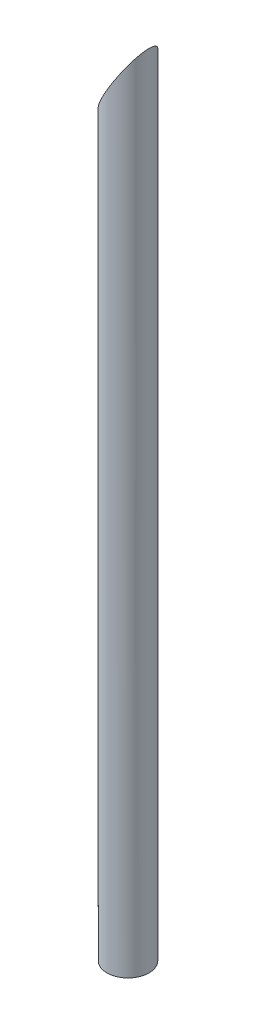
from build123d import *

# Parameters (mm, degrees)
SKETCH2_R               = 2.5
BOSS_EXTRUDE1_DEPTH     = 95
CUT_EXTRUDE1_DEPTH      = 95
CUT_EXTRUDE1_DEPTH_BACK = 95


with BuildPart() as part:
    # Sketch2 → Boss-Extrude1 (new body)
    with BuildSketch(Plane(origin=(0, 0, 0), x_dir=(1, 0, 0), z_dir=(0, 1, 0))):
        with Locations(Location((0, 0, 0), (0, 0, 270))):
            Circle(SKETCH2_R)
    extrude(amount=BOSS_EXTRUDE1_DEPTH)

    # Sketch3 → Cut-Extrude1 (cut, two sides: drawn at the far end of the back side and taken through both)
    with BuildSketch(Plane.XY.offset(-CUT_EXTRUDE1_DEPTH_BACK)):
        Polygon((-2.5, 95), (2.5, 95), (-2.5, 86.459342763), align=None)
    extrude(amount=CUT_EXTRUDE1_DEPTH + CUT_EXTRUDE1_DEPTH_BACK, mode=Mode.SUBTRACT)


solid = part.part
